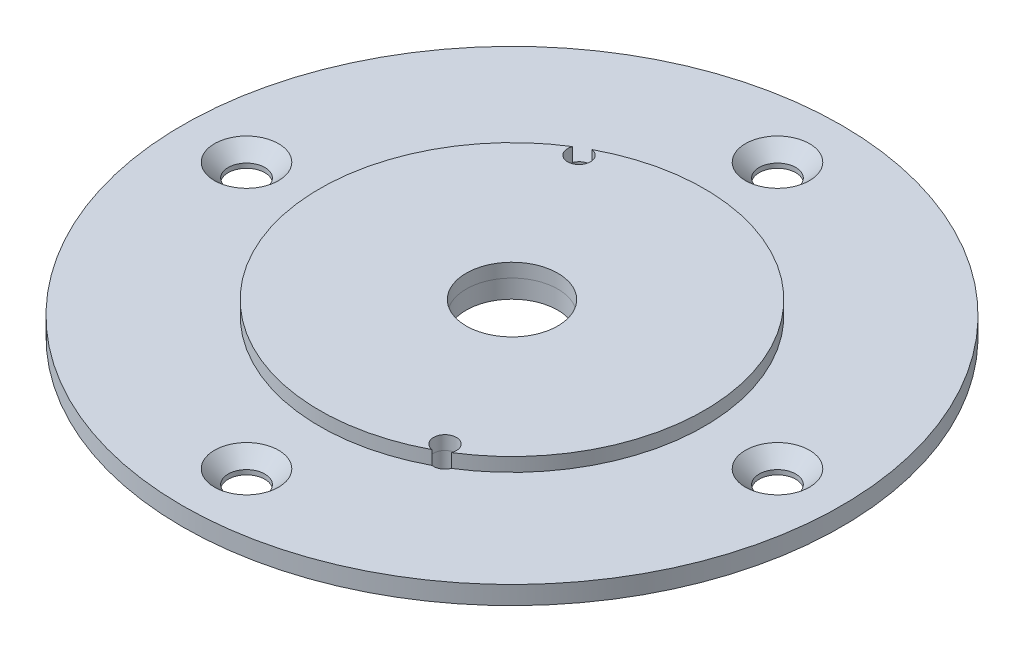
from build123d import *

# Parameters (mm, degrees)
ESQUISSE1_R                                 = 36
ESQUISSE1_R_2                               = 5
BOSS_EXTRU_1_DEPTH                          = 1
FRAISAGE_POUR_VIS_T_TE_FRAIS_E_M41_AT_COUNT = 2
FRAISAGE_POUR_VIS_T_TE_FRAIS_E_M41_AT_PITCH = 58
FRAISAGE_POUR_VIS_T_TE_FRAIS_E_M41_2_COUNT  = 2
FRAISAGE_POUR_VIS_T_TE_FRAIS_E_M41_2_PITCH  = 41.012193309
FRAISAGE_POUR_VIS_T_TE_FRAIS_E_M41_3_COUNT  = 2
FRAISAGE_POUR_VIS_T_TE_FRAIS_E_M41_3_PITCH  = 41.012193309
TROU_TARAUD_M31_D                           = 2.5
ESQUISSE6_R                                 = 5
BOSS_EXTRU_2_DEPTH                          = 1.5


with BuildPart() as part:
    # Esquisse1 → Boss.-Extru.1 (new, symmetric)
    with BuildSketch(Plane(origin=(0, 0, 0), x_dir=(1, 0, 0), z_dir=(0, 1, 0))):
        with Locations(Location((0, 0, 0), (0, 0, 270))):
            Circle(ESQUISSE1_R)
        with Locations(Location((0, 0, 0), (0, 0, 270))):
            Circle(ESQUISSE1_R_2, mode=Mode.SUBTRACT)
    extrude(amount=BOSS_EXTRU_1_DEPTH, both=True)

    # Esquisse2 → Fraisage pour vis _ t_te frais_e M41 (revolve, cut)
    with BuildSketch(Plane(origin=(-29, 1, 0), x_dir=(0, 0, 1), z_dir=(1, 0, 0))):
        Polygon((0, 0), (0, 2), (2, 2), (2, 1.5), (3.5, 0), align=None)
    fraisage_pour_vis_t_te_frais_e_m41 = revolve(axis=Axis((-29, 7.35, 0), (0, -1, 0)), mode=Mode.SUBTRACT)

    # Fraisage pour vis _ t_te frais_e M41 at: Fraisage pour vis _ t_te frais_e M41 ×2
    with Locations(*[(i * FRAISAGE_POUR_VIS_T_TE_FRAIS_E_M41_AT_PITCH, 0, 0) for i in range(1, FRAISAGE_POUR_VIS_T_TE_FRAIS_E_M41_AT_COUNT)]):
        add(fraisage_pour_vis_t_te_frais_e_m41, mode=Mode.SUBTRACT)

    # Fraisage pour vis _ t_te frais_e M41 2: Fraisage pour vis _ t_te frais_e M41 ×2
    with Locations(*[Vector(0.7071067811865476, 0, -0.7071067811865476) * (i * FRAISAGE_POUR_VIS_T_TE_FRAIS_E_M41_2_PITCH) for i in range(1, FRAISAGE_POUR_VIS_T_TE_FRAIS_E_M41_2_COUNT)]):
        add(fraisage_pour_vis_t_te_frais_e_m41, mode=Mode.SUBTRACT)

    # Fraisage pour vis _ t_te frais_e M41 3: Fraisage pour vis _ t_te frais_e M41 ×2
    with Locations(*[Vector(0.7071067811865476, 0, 0.7071067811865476) * (i * FRAISAGE_POUR_VIS_T_TE_FRAIS_E_M41_3_PITCH) for i in range(1, FRAISAGE_POUR_VIS_T_TE_FRAIS_E_M41_3_COUNT)]):
        add(fraisage_pour_vis_t_te_frais_e_m41, mode=Mode.SUBTRACT)

    # Trou taraud_ M31 (through all)
    with Locations(Plane(origin=(0, 1, 0), x_dir=(1, 0, 0), z_dir=(0, 1, 0))):
        with Locations((-10, 17.320508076), (10, -17.320508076)):
            Hole(TROU_TARAUD_M31_D / 2)


with BuildPart() as body_2:
    # Esquisse6 → Boss.-Extru.2 (new body)
    with BuildSketch(Plane(origin=(0, 1, 0), x_dir=(1, 0, 0), z_dir=(0, 1, 0))):
        with BuildLine():
            ThreePointArc((-11.158416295, 17.790158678), (-18.186533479, -10.5), (9.827521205, -18.558551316))
            ThreePointArc((9.827521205, -18.558551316), (9.375, -16.237976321), (11.158416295, -17.790158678))
            ThreePointArc((11.158416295, -17.790158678), (18.186533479, 10.5), (-9.827521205, 18.558551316))
            ThreePointArc((-9.827521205, 18.558551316), (-9.375, 16.237976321), (-11.158416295, 17.790158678))
        make_face()
        with Locations(Location((0, 0, 0), (0, 0, 270))):
            Circle(ESQUISSE6_R, mode=Mode.SUBTRACT)
    extrude(amount=BOSS_EXTRU_2_DEPTH)


solid = Compound([part.part, body_2.part])
